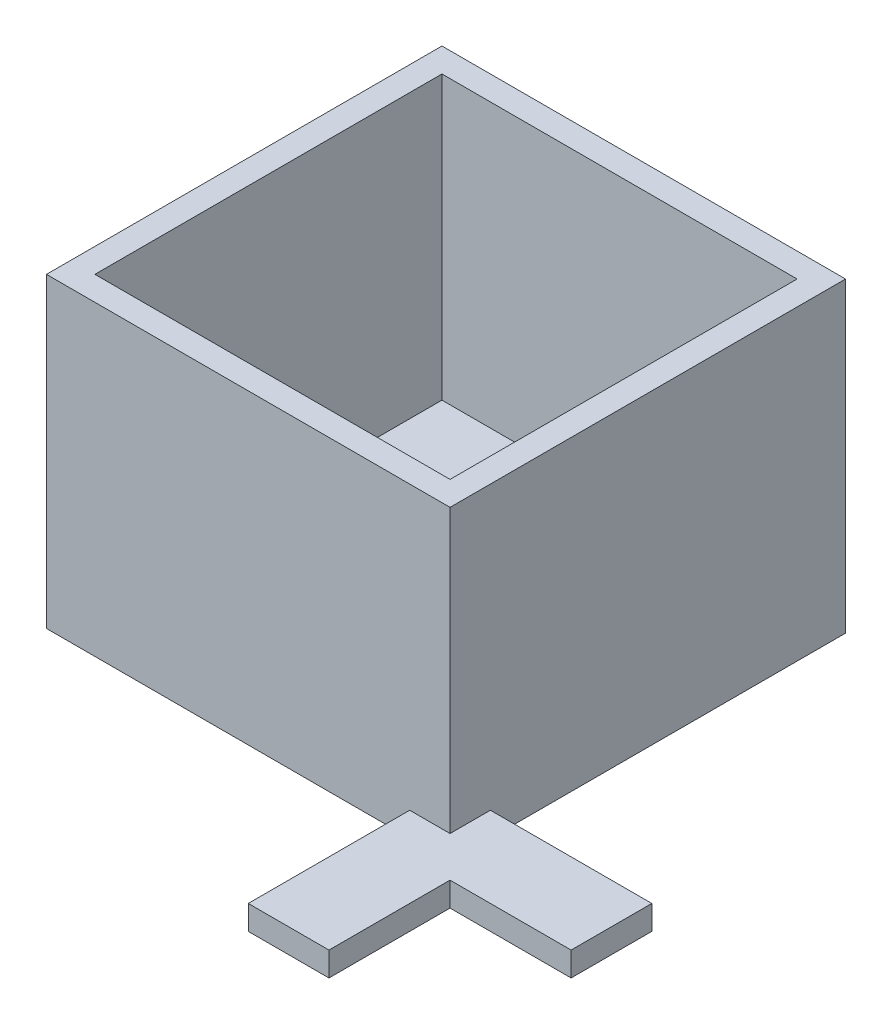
ISO-10303-21;
HEADER;
FILE_DESCRIPTION(('STEP AP214'),'2;1');
FILE_NAME('part.step','',(''),(''),'','','');
FILE_SCHEMA(('AUTOMOTIVE_DESIGN { 1 0 10303 214 1 1 1 1 }'));
ENDSEC;
DATA;
#1=APPLICATION_CONTEXT('core data for automotive mechanical design processes');
#2=APPLICATION_PROTOCOL_DEFINITION('international standard','automotive_design',2000,#1);
#3=PRODUCT_CONTEXT('',#1,'mechanical');
#4=PRODUCT('Part','Part','',(#3));
#5=PRODUCT_RELATED_PRODUCT_CATEGORY('part','',(#4));
#6=PRODUCT_DEFINITION_FORMATION('','',#4);
#7=PRODUCT_DEFINITION_CONTEXT('part definition',#1,'design');
#8=PRODUCT_DEFINITION('design','',#6,#7);
#9=PRODUCT_DEFINITION_SHAPE('','',#8);
#10=(LENGTH_UNIT() NAMED_UNIT(*) SI_UNIT(.MILLI.,.METRE.));
#11=(NAMED_UNIT(*) PLANE_ANGLE_UNIT() SI_UNIT($,.RADIAN.));
#12=(NAMED_UNIT(*) SI_UNIT($,.STERADIAN.) SOLID_ANGLE_UNIT());
#13=UNCERTAINTY_MEASURE_WITH_UNIT(LENGTH_MEASURE(1.E-05),#10,'distance_accuracy_value','');
#14=(GEOMETRIC_REPRESENTATION_CONTEXT(3) GLOBAL_UNCERTAINTY_ASSIGNED_CONTEXT((#13)) GLOBAL_UNIT_ASSIGNED_CONTEXT((#10,
#11,#12)) REPRESENTATION_CONTEXT('',''));
#15=CARTESIAN_POINT('',(0.,0.,0.));
#16=DIRECTION('',(0.,0.,1.));
#17=DIRECTION('',(1.,0.,0.));
#18=AXIS2_PLACEMENT_3D('',#15,#16,#17);
#19=CARTESIAN_POINT('',(0.,38.,0.));
#20=DIRECTION('',(1.,0.,0.));
#21=DIRECTION('',(0.,0.,-1.));
#22=AXIS2_PLACEMENT_3D('',#19,#20,#21);
#23=PLANE('',#22);
#24=DIRECTION('',(0.,0.,1.));
#25=VECTOR('',#24,1.);
#26=CARTESIAN_POINT('',(0.,0.,0.));
#27=LINE('',#26,#25);
#28=CARTESIAN_POINT('',(0.,0.,-49.));
#29=VERTEX_POINT('',#28);
#30=CARTESIAN_POINT('',(0.,0.,0.));
#31=VERTEX_POINT('',#30);
#32=EDGE_CURVE('E275',#29,#31,#27,.T.);
#33=ORIENTED_EDGE('',*,*,#32,.T.);
#34=DIRECTION('',(0.,-1.,0.));
#35=VECTOR('',#34,1.);
#36=CARTESIAN_POINT('',(0.,38.,0.));
#37=LINE('',#36,#35);
#38=CARTESIAN_POINT('',(0.,38.,0.));
#39=VERTEX_POINT('',#38);
#40=EDGE_CURVE('E12',#39,#31,#37,.T.);
#41=ORIENTED_EDGE('',*,*,#40,.F.);
#42=DIRECTION('',(0.,0.,1.));
#43=VECTOR('',#42,1.);
#44=CARTESIAN_POINT('',(0.,38.,0.));
#45=LINE('',#44,#43);
#46=CARTESIAN_POINT('',(0.,38.,-49.));
#47=VERTEX_POINT('',#46);
#48=EDGE_CURVE('E276',#47,#39,#45,.T.);
#49=ORIENTED_EDGE('',*,*,#48,.F.);
#50=DIRECTION('',(0.,-1.,0.));
#51=VECTOR('',#50,1.);
#52=CARTESIAN_POINT('',(0.,38.,-49.));
#53=LINE('',#52,#51);
#54=EDGE_CURVE('E290',#47,#29,#53,.T.);
#55=ORIENTED_EDGE('',*,*,#54,.T.);
#56=EDGE_LOOP('',(#33,#41,#49,#55));
#57=FACE_BOUND('',#56,.T.);
#58=ADVANCED_FACE('F41',(#57),#23,.F.);
#59=CARTESIAN_POINT('',(0.,38.,0.));
#60=DIRECTION('',(0.,0.,-1.));
#61=DIRECTION('',(-1.,0.,0.));
#62=AXIS2_PLACEMENT_3D('',#59,#60,#61);
#63=PLANE('',#62);
#64=DIRECTION('',(1.,0.,0.));
#65=VECTOR('',#64,1.);
#66=CARTESIAN_POINT('',(0.,0.,0.));
#67=LINE('',#66,#65);
#68=CARTESIAN_POINT('',(45.,0.,0.));
#69=VERTEX_POINT('',#68);
#70=EDGE_CURVE('E294',#31,#69,#67,.T.);
#71=ORIENTED_EDGE('',*,*,#70,.T.);
#72=DIRECTION('',(0.,-1.,0.));
#73=VECTOR('',#72,1.);
#74=CARTESIAN_POINT('',(45.,3.,0.));
#75=LINE('',#74,#73);
#76=CARTESIAN_POINT('',(45.,3.,0.));
#77=VERTEX_POINT('',#76);
#78=EDGE_CURVE('E56',#77,#69,#75,.T.);
#79=ORIENTED_EDGE('',*,*,#78,.F.);
#80=DIRECTION('',(1.,0.,0.));
#81=VECTOR('',#80,1.);
#82=CARTESIAN_POINT('',(50.,3.,0.));
#83=LINE('',#82,#81);
#84=CARTESIAN_POINT('',(50.,3.,0.));
#85=VERTEX_POINT('',#84);
#86=EDGE_CURVE('E193',#77,#85,#83,.T.);
#87=ORIENTED_EDGE('',*,*,#86,.T.);
#88=DIRECTION('',(0.,-1.,0.));
#89=VECTOR('',#88,1.);
#90=CARTESIAN_POINT('',(50.,38.,0.));
#91=LINE('',#90,#89);
#92=CARTESIAN_POINT('',(50.,38.,0.));
#93=VERTEX_POINT('',#92);
#94=EDGE_CURVE('E49',#93,#85,#91,.T.);
#95=ORIENTED_EDGE('',*,*,#94,.F.);
#96=DIRECTION('',(1.,0.,0.));
#97=VECTOR('',#96,1.);
#98=CARTESIAN_POINT('',(0.,38.,0.));
#99=LINE('',#98,#97);
#100=EDGE_CURVE('E280',#39,#93,#99,.T.);
#101=ORIENTED_EDGE('',*,*,#100,.F.);
#102=ORIENTED_EDGE('',*,*,#40,.T.);
#103=EDGE_LOOP('',(#71,#79,#87,#95,#101,#102));
#104=FACE_BOUND('',#103,.T.);
#105=ADVANCED_FACE('F316',(#104),#63,.F.);
#106=CARTESIAN_POINT('',(50.,38.,0.));
#107=DIRECTION('',(-1.,0.,0.));
#108=DIRECTION('',(0.,0.,1.));
#109=AXIS2_PLACEMENT_3D('',#106,#107,#108);
#110=PLANE('',#109);
#111=DIRECTION('',(0.,0.,-1.));
#112=VECTOR('',#111,1.);
#113=CARTESIAN_POINT('',(50.,3.,-5.));
#114=LINE('',#113,#112);
#115=CARTESIAN_POINT('',(50.,3.,-5.));
#116=VERTEX_POINT('',#115);
#117=EDGE_CURVE('E64',#85,#116,#114,.T.);
#118=ORIENTED_EDGE('',*,*,#117,.T.);
#119=DIRECTION('',(0.,-1.,0.));
#120=VECTOR('',#119,1.);
#121=CARTESIAN_POINT('',(50.,3.,-5.));
#122=LINE('',#121,#120);
#123=CARTESIAN_POINT('',(50.,0.,-5.));
#124=VERTEX_POINT('',#123);
#125=EDGE_CURVE('E161',#116,#124,#122,.T.);
#126=ORIENTED_EDGE('',*,*,#125,.T.);
#127=DIRECTION('',(0.,0.,-1.));
#128=VECTOR('',#127,1.);
#129=CARTESIAN_POINT('',(50.,0.,0.));
#130=LINE('',#129,#128);
#131=CARTESIAN_POINT('',(50.,0.,-49.));
#132=VERTEX_POINT('',#131);
#133=EDGE_CURVE('E297',#124,#132,#130,.T.);
#134=ORIENTED_EDGE('',*,*,#133,.T.);
#135=DIRECTION('',(0.,-1.,0.));
#136=VECTOR('',#135,1.);
#137=CARTESIAN_POINT('',(50.,38.,-49.));
#138=LINE('',#137,#136);
#139=CARTESIAN_POINT('',(50.,38.,-49.));
#140=VERTEX_POINT('',#139);
#141=EDGE_CURVE('E305',#140,#132,#138,.T.);
#142=ORIENTED_EDGE('',*,*,#141,.F.);
#143=DIRECTION('',(0.,0.,-1.));
#144=VECTOR('',#143,1.);
#145=CARTESIAN_POINT('',(50.,38.,0.));
#146=LINE('',#145,#144);
#147=EDGE_CURVE('E284',#93,#140,#146,.T.);
#148=ORIENTED_EDGE('',*,*,#147,.F.);
#149=ORIENTED_EDGE('',*,*,#94,.T.);
#150=EDGE_LOOP('',(#118,#126,#134,#142,#148,#149));
#151=FACE_BOUND('',#150,.T.);
#152=ADVANCED_FACE('F311',(#151),#110,.F.);
#153=CARTESIAN_POINT('',(0.,38.,-49.));
#154=DIRECTION('',(0.,0.,1.));
#155=DIRECTION('',(1.,0.,0.));
#156=AXIS2_PLACEMENT_3D('',#153,#154,#155);
#157=PLANE('',#156);
#158=DIRECTION('',(-1.,0.,0.));
#159=VECTOR('',#158,1.);
#160=CARTESIAN_POINT('',(0.,0.,-49.));
#161=LINE('',#160,#159);
#162=EDGE_CURVE('E281',#132,#29,#161,.T.);
#163=ORIENTED_EDGE('',*,*,#162,.T.);
#164=ORIENTED_EDGE('',*,*,#54,.F.);
#165=DIRECTION('',(-1.,0.,0.));
#166=VECTOR('',#165,1.);
#167=CARTESIAN_POINT('',(0.,38.,-49.));
#168=LINE('',#167,#166);
#169=EDGE_CURVE('E287',#140,#47,#168,.T.);
#170=ORIENTED_EDGE('',*,*,#169,.F.);
#171=ORIENTED_EDGE('',*,*,#141,.T.);
#172=EDGE_LOOP('',(#163,#164,#170,#171));
#173=FACE_BOUND('',#172,.T.);
#174=ADVANCED_FACE('F322',(#173),#157,.F.);
#175=CARTESIAN_POINT('',(0.,38.,0.));
#176=DIRECTION('',(0.,-1.,0.));
#177=DIRECTION('',(0.,0.,-1.));
#178=AXIS2_PLACEMENT_3D('',#175,#176,#177);
#179=PLANE('',#178);
#180=DIRECTION('',(1.,0.,0.));
#181=VECTOR('',#180,1.);
#182=CARTESIAN_POINT('',(3.,38.,-3.));
#183=LINE('',#182,#181);
#184=CARTESIAN_POINT('',(3.,38.,-3.));
#185=VERTEX_POINT('',#184);
#186=CARTESIAN_POINT('',(47.,38.,-3.));
#187=VERTEX_POINT('',#186);
#188=EDGE_CURVE('E236',#185,#187,#183,.T.);
#189=ORIENTED_EDGE('',*,*,#188,.F.);
#190=DIRECTION('',(0.,0.,1.));
#191=VECTOR('',#190,1.);
#192=CARTESIAN_POINT('',(3.,38.,-46.));
#193=LINE('',#192,#191);
#194=CARTESIAN_POINT('',(3.,38.,-46.));
#195=VERTEX_POINT('',#194);
#196=EDGE_CURVE('E240',#195,#185,#193,.T.);
#197=ORIENTED_EDGE('',*,*,#196,.F.);
#198=DIRECTION('',(-1.,0.,0.));
#199=VECTOR('',#198,1.);
#200=CARTESIAN_POINT('',(47.,38.,-46.));
#201=LINE('',#200,#199);
#202=CARTESIAN_POINT('',(47.,38.,-46.));
#203=VERTEX_POINT('',#202);
#204=EDGE_CURVE('E218',#203,#195,#201,.T.);
#205=ORIENTED_EDGE('',*,*,#204,.F.);
#206=DIRECTION('',(0.,0.,-1.));
#207=VECTOR('',#206,1.);
#208=CARTESIAN_POINT('',(47.,38.,-3.));
#209=LINE('',#208,#207);
#210=EDGE_CURVE('E232',#187,#203,#209,.T.);
#211=ORIENTED_EDGE('',*,*,#210,.F.);
#212=EDGE_LOOP('',(#189,#197,#205,#211));
#213=FACE_BOUND('',#212,.T.);
#214=ORIENTED_EDGE('',*,*,#48,.T.);
#215=ORIENTED_EDGE('',*,*,#100,.T.);
#216=ORIENTED_EDGE('',*,*,#147,.T.);
#217=ORIENTED_EDGE('',*,*,#169,.T.);
#218=EDGE_LOOP('',(#214,#215,#216,#217));
#219=FACE_BOUND('',#218,.T.);
#220=ADVANCED_FACE('F328',(#213,#219),#179,.F.);
#221=CARTESIAN_POINT('',(0.,0.,0.));
#222=DIRECTION('',(0.,-1.,0.));
#223=DIRECTION('',(0.,0.,-1.));
#224=AXIS2_PLACEMENT_3D('',#221,#222,#223);
#225=PLANE('',#224);
#226=ORIENTED_EDGE('',*,*,#133,.F.);
#227=DIRECTION('',(1.,0.,0.));
#228=VECTOR('',#227,1.);
#229=CARTESIAN_POINT('',(70.,0.,-5.));
#230=LINE('',#229,#228);
#231=CARTESIAN_POINT('',(70.,0.,-5.));
#232=VERTEX_POINT('',#231);
#233=EDGE_CURVE('E196',#124,#232,#230,.T.);
#234=ORIENTED_EDGE('',*,*,#233,.T.);
#235=DIRECTION('',(0.,0.,1.));
#236=VECTOR('',#235,1.);
#237=CARTESIAN_POINT('',(70.,0.,5.));
#238=LINE('',#237,#236);
#239=CARTESIAN_POINT('',(70.,0.,5.));
#240=VERTEX_POINT('',#239);
#241=EDGE_CURVE('E154',#232,#240,#238,.T.);
#242=ORIENTED_EDGE('',*,*,#241,.T.);
#243=DIRECTION('',(-1.,0.,0.));
#244=VECTOR('',#243,1.);
#245=CARTESIAN_POINT('',(55.,0.,5.));
#246=LINE('',#245,#244);
#247=CARTESIAN_POINT('',(55.,0.,5.));
#248=VERTEX_POINT('',#247);
#249=EDGE_CURVE('E201',#240,#248,#246,.T.);
#250=ORIENTED_EDGE('',*,*,#249,.T.);
#251=DIRECTION('',(0.,0.,1.));
#252=VECTOR('',#251,1.);
#253=CARTESIAN_POINT('',(55.,0.,20.));
#254=LINE('',#253,#252);
#255=CARTESIAN_POINT('',(55.,0.,20.));
#256=VERTEX_POINT('',#255);
#257=EDGE_CURVE('E205',#248,#256,#254,.T.);
#258=ORIENTED_EDGE('',*,*,#257,.T.);
#259=DIRECTION('',(-1.,0.,0.));
#260=VECTOR('',#259,1.);
#261=CARTESIAN_POINT('',(45.,0.,20.));
#262=LINE('',#261,#260);
#263=CARTESIAN_POINT('',(45.,0.,20.));
#264=VERTEX_POINT('',#263);
#265=EDGE_CURVE('E209',#256,#264,#262,.T.);
#266=ORIENTED_EDGE('',*,*,#265,.T.);
#267=DIRECTION('',(0.,0.,-1.));
#268=VECTOR('',#267,1.);
#269=CARTESIAN_POINT('',(45.,0.,0.));
#270=LINE('',#269,#268);
#271=EDGE_CURVE('E177',#264,#69,#270,.T.);
#272=ORIENTED_EDGE('',*,*,#271,.T.);
#273=ORIENTED_EDGE('',*,*,#70,.F.);
#274=ORIENTED_EDGE('',*,*,#32,.F.);
#275=ORIENTED_EDGE('',*,*,#162,.F.);
#276=EDGE_LOOP('',(#226,#234,#242,#250,#258,#266,#272,#273,#274,#275));
#277=FACE_BOUND('',#276,.T.);
#278=ADVANCED_FACE('F330',(#277),#225,.T.);
#279=CARTESIAN_POINT('',(0.,3.,0.));
#280=DIRECTION('',(0.,-1.,0.));
#281=DIRECTION('',(0.,0.,-1.));
#282=AXIS2_PLACEMENT_3D('',#279,#280,#281);
#283=PLANE('',#282);
#284=DIRECTION('',(-1.,0.,0.));
#285=VECTOR('',#284,1.);
#286=CARTESIAN_POINT('',(47.,3.,-46.));
#287=LINE('',#286,#285);
#288=CARTESIAN_POINT('',(47.,3.,-46.));
#289=VERTEX_POINT('',#288);
#290=CARTESIAN_POINT('',(3.,3.,-46.));
#291=VERTEX_POINT('',#290);
#292=EDGE_CURVE('E251',#289,#291,#287,.T.);
#293=ORIENTED_EDGE('',*,*,#292,.T.);
#294=DIRECTION('',(0.,0.,1.));
#295=VECTOR('',#294,1.);
#296=CARTESIAN_POINT('',(3.,3.,-46.));
#297=LINE('',#296,#295);
#298=CARTESIAN_POINT('',(3.,2.99999999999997,-3.));
#299=VERTEX_POINT('',#298);
#300=EDGE_CURVE('E235',#291,#299,#297,.T.);
#301=ORIENTED_EDGE('',*,*,#300,.T.);
#302=DIRECTION('',(1.,0.,0.));
#303=VECTOR('',#302,1.);
#304=CARTESIAN_POINT('',(3.,3.,-3.));
#305=LINE('',#304,#303);
#306=CARTESIAN_POINT('',(47.,3.,-3.));
#307=VERTEX_POINT('',#306);
#308=EDGE_CURVE('E262',#299,#307,#305,.T.);
#309=ORIENTED_EDGE('',*,*,#308,.T.);
#310=DIRECTION('',(0.,0.,-1.));
#311=VECTOR('',#310,1.);
#312=CARTESIAN_POINT('',(47.,3.,-3.));
#313=LINE('',#312,#311);
#314=EDGE_CURVE('E257',#307,#289,#313,.T.);
#315=ORIENTED_EDGE('',*,*,#314,.T.);
#316=EDGE_LOOP('',(#293,#301,#309,#315));
#317=FACE_BOUND('',#316,.T.);
#318=ADVANCED_FACE('F333',(#317),#283,.F.);
#319=CARTESIAN_POINT('',(3.,-61.5223536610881,-46.));
#320=DIRECTION('',(-1.,0.,0.));
#321=DIRECTION('',(0.,0.,1.));
#322=AXIS2_PLACEMENT_3D('',#319,#320,#321);
#323=PLANE('',#322);
#324=DIRECTION('',(0.,1.,0.));
#325=VECTOR('',#324,1.);
#326=CARTESIAN_POINT('',(3.,-61.5223536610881,-46.));
#327=LINE('',#326,#325);
#328=EDGE_CURVE('E255',#291,#195,#327,.T.);
#329=ORIENTED_EDGE('',*,*,#328,.T.);
#330=ORIENTED_EDGE('',*,*,#196,.T.);
#331=DIRECTION('',(0.,1.,0.));
#332=VECTOR('',#331,1.);
#333=CARTESIAN_POINT('',(3.,-61.5223536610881,-3.));
#334=LINE('',#333,#332);
#335=EDGE_CURVE('E250',#299,#185,#334,.T.);
#336=ORIENTED_EDGE('',*,*,#335,.F.);
#337=ORIENTED_EDGE('',*,*,#300,.F.);
#338=EDGE_LOOP('',(#329,#330,#336,#337));
#339=FACE_BOUND('',#338,.T.);
#340=ADVANCED_FACE('F340',(#339),#323,.F.);
#341=CARTESIAN_POINT('',(3.,-61.5223536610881,-3.));
#342=DIRECTION('',(0.,0.,1.));
#343=DIRECTION('',(1.,0.,0.));
#344=AXIS2_PLACEMENT_3D('',#341,#342,#343);
#345=PLANE('',#344);
#346=ORIENTED_EDGE('',*,*,#335,.T.);
#347=ORIENTED_EDGE('',*,*,#188,.T.);
#348=DIRECTION('',(0.,1.,0.));
#349=VECTOR('',#348,1.);
#350=CARTESIAN_POINT('',(47.,-61.5223536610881,-3.));
#351=LINE('',#350,#349);
#352=EDGE_CURVE('E261',#307,#187,#351,.T.);
#353=ORIENTED_EDGE('',*,*,#352,.F.);
#354=ORIENTED_EDGE('',*,*,#308,.F.);
#355=EDGE_LOOP('',(#346,#347,#353,#354));
#356=FACE_BOUND('',#355,.T.);
#357=ADVANCED_FACE('F344',(#356),#345,.F.);
#358=CARTESIAN_POINT('',(47.,-61.5223536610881,-3.));
#359=DIRECTION('',(1.,0.,0.));
#360=DIRECTION('',(0.,0.,-1.));
#361=AXIS2_PLACEMENT_3D('',#358,#359,#360);
#362=PLANE('',#361);
#363=ORIENTED_EDGE('',*,*,#352,.T.);
#364=ORIENTED_EDGE('',*,*,#210,.T.);
#365=DIRECTION('',(0.,1.,0.));
#366=VECTOR('',#365,1.);
#367=CARTESIAN_POINT('',(47.,-61.5223536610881,-46.));
#368=LINE('',#367,#366);
#369=EDGE_CURVE('E256',#289,#203,#368,.T.);
#370=ORIENTED_EDGE('',*,*,#369,.F.);
#371=ORIENTED_EDGE('',*,*,#314,.F.);
#372=EDGE_LOOP('',(#363,#364,#370,#371));
#373=FACE_BOUND('',#372,.T.);
#374=ADVANCED_FACE('F348',(#373),#362,.F.);
#375=CARTESIAN_POINT('',(47.,-61.5223536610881,-46.));
#376=DIRECTION('',(0.,0.,-1.));
#377=DIRECTION('',(-1.,0.,0.));
#378=AXIS2_PLACEMENT_3D('',#375,#376,#377);
#379=PLANE('',#378);
#380=ORIENTED_EDGE('',*,*,#369,.T.);
#381=ORIENTED_EDGE('',*,*,#204,.T.);
#382=ORIENTED_EDGE('',*,*,#328,.F.);
#383=ORIENTED_EDGE('',*,*,#292,.F.);
#384=EDGE_LOOP('',(#380,#381,#382,#383));
#385=FACE_BOUND('',#384,.T.);
#386=ADVANCED_FACE('F352',(#385),#379,.F.);
#387=CARTESIAN_POINT('',(45.,3.,0.));
#388=DIRECTION('',(-1.,0.,0.));
#389=DIRECTION('',(0.,0.,1.));
#390=AXIS2_PLACEMENT_3D('',#387,#388,#389);
#391=PLANE('',#390);
#392=ORIENTED_EDGE('',*,*,#271,.F.);
#393=DIRECTION('',(0.,-1.,0.));
#394=VECTOR('',#393,1.);
#395=CARTESIAN_POINT('',(45.,3.,20.));
#396=LINE('',#395,#394);
#397=CARTESIAN_POINT('',(45.,3.,20.));
#398=VERTEX_POINT('',#397);
#399=EDGE_CURVE('E219',#398,#264,#396,.T.);
#400=ORIENTED_EDGE('',*,*,#399,.F.);
#401=DIRECTION('',(0.,0.,-1.));
#402=VECTOR('',#401,1.);
#403=CARTESIAN_POINT('',(45.,3.,0.));
#404=LINE('',#403,#402);
#405=EDGE_CURVE('E190',#398,#77,#404,.T.);
#406=ORIENTED_EDGE('',*,*,#405,.T.);
#407=ORIENTED_EDGE('',*,*,#78,.T.);
#408=EDGE_LOOP('',(#392,#400,#406,#407));
#409=FACE_BOUND('',#408,.T.);
#410=ADVANCED_FACE('F356',(#409),#391,.T.);
#411=CARTESIAN_POINT('',(45.,3.,20.));
#412=DIRECTION('',(0.,0.,1.));
#413=DIRECTION('',(1.,0.,0.));
#414=AXIS2_PLACEMENT_3D('',#411,#412,#413);
#415=PLANE('',#414);
#416=ORIENTED_EDGE('',*,*,#265,.F.);
#417=DIRECTION('',(0.,-1.,0.));
#418=VECTOR('',#417,1.);
#419=CARTESIAN_POINT('',(55.,3.,20.));
#420=LINE('',#419,#418);
#421=CARTESIAN_POINT('',(55.,3.,20.));
#422=VERTEX_POINT('',#421);
#423=EDGE_CURVE('E222',#422,#256,#420,.T.);
#424=ORIENTED_EDGE('',*,*,#423,.F.);
#425=DIRECTION('',(-1.,0.,0.));
#426=VECTOR('',#425,1.);
#427=CARTESIAN_POINT('',(45.,3.,20.));
#428=LINE('',#427,#426);
#429=EDGE_CURVE('E186',#422,#398,#428,.T.);
#430=ORIENTED_EDGE('',*,*,#429,.T.);
#431=ORIENTED_EDGE('',*,*,#399,.T.);
#432=EDGE_LOOP('',(#416,#424,#430,#431));
#433=FACE_BOUND('',#432,.T.);
#434=ADVANCED_FACE('F369',(#433),#415,.T.);
#435=CARTESIAN_POINT('',(55.,3.,20.));
#436=DIRECTION('',(1.,0.,0.));
#437=DIRECTION('',(0.,0.,-1.));
#438=AXIS2_PLACEMENT_3D('',#435,#436,#437);
#439=PLANE('',#438);
#440=ORIENTED_EDGE('',*,*,#257,.F.);
#441=DIRECTION('',(0.,-1.,0.));
#442=VECTOR('',#441,1.);
#443=CARTESIAN_POINT('',(55.,3.,5.));
#444=LINE('',#443,#442);
#445=CARTESIAN_POINT('',(55.,3.,5.));
#446=VERTEX_POINT('',#445);
#447=EDGE_CURVE('E225',#446,#248,#444,.T.);
#448=ORIENTED_EDGE('',*,*,#447,.F.);
#449=DIRECTION('',(0.,0.,1.));
#450=VECTOR('',#449,1.);
#451=CARTESIAN_POINT('',(55.,3.,20.));
#452=LINE('',#451,#450);
#453=EDGE_CURVE('E182',#446,#422,#452,.T.);
#454=ORIENTED_EDGE('',*,*,#453,.T.);
#455=ORIENTED_EDGE('',*,*,#423,.T.);
#456=EDGE_LOOP('',(#440,#448,#454,#455));
#457=FACE_BOUND('',#456,.T.);
#458=ADVANCED_FACE('F365',(#457),#439,.T.);
#459=CARTESIAN_POINT('',(55.,3.,5.));
#460=DIRECTION('',(0.,0.,1.));
#461=DIRECTION('',(1.,0.,0.));
#462=AXIS2_PLACEMENT_3D('',#459,#460,#461);
#463=PLANE('',#462);
#464=ORIENTED_EDGE('',*,*,#249,.F.);
#465=DIRECTION('',(0.,-1.,0.));
#466=VECTOR('',#465,1.);
#467=CARTESIAN_POINT('',(70.,3.,5.));
#468=LINE('',#467,#466);
#469=CARTESIAN_POINT('',(70.,3.,5.));
#470=VERTEX_POINT('',#469);
#471=EDGE_CURVE('E160',#470,#240,#468,.T.);
#472=ORIENTED_EDGE('',*,*,#471,.F.);
#473=DIRECTION('',(-1.,0.,0.));
#474=VECTOR('',#473,1.);
#475=CARTESIAN_POINT('',(55.,3.,5.));
#476=LINE('',#475,#474);
#477=EDGE_CURVE('E170',#470,#446,#476,.T.);
#478=ORIENTED_EDGE('',*,*,#477,.T.);
#479=ORIENTED_EDGE('',*,*,#447,.T.);
#480=EDGE_LOOP('',(#464,#472,#478,#479));
#481=FACE_BOUND('',#480,.T.);
#482=ADVANCED_FACE('F362',(#481),#463,.T.);
#483=CARTESIAN_POINT('',(70.,3.,5.));
#484=DIRECTION('',(1.,0.,0.));
#485=DIRECTION('',(0.,0.,-1.));
#486=AXIS2_PLACEMENT_3D('',#483,#484,#485);
#487=PLANE('',#486);
#488=ORIENTED_EDGE('',*,*,#241,.F.);
#489=DIRECTION('',(0.,-1.,0.));
#490=VECTOR('',#489,1.);
#491=CARTESIAN_POINT('',(70.,3.,-5.));
#492=LINE('',#491,#490);
#493=CARTESIAN_POINT('',(70.,3.,-5.));
#494=VERTEX_POINT('',#493);
#495=EDGE_CURVE('E149',#494,#232,#492,.T.);
#496=ORIENTED_EDGE('',*,*,#495,.F.);
#497=DIRECTION('',(0.,0.,1.));
#498=VECTOR('',#497,1.);
#499=CARTESIAN_POINT('',(70.,3.,5.));
#500=LINE('',#499,#498);
#501=EDGE_CURVE('E152',#494,#470,#500,.T.);
#502=ORIENTED_EDGE('',*,*,#501,.T.);
#503=ORIENTED_EDGE('',*,*,#471,.T.);
#504=EDGE_LOOP('',(#488,#496,#502,#503));
#505=FACE_BOUND('',#504,.T.);
#506=ADVANCED_FACE('F151',(#505),#487,.T.);
#507=CARTESIAN_POINT('',(70.,3.,-5.));
#508=DIRECTION('',(0.,0.,-1.));
#509=DIRECTION('',(-1.,0.,0.));
#510=AXIS2_PLACEMENT_3D('',#507,#508,#509);
#511=PLANE('',#510);
#512=ORIENTED_EDGE('',*,*,#233,.F.);
#513=ORIENTED_EDGE('',*,*,#125,.F.);
#514=DIRECTION('',(1.,0.,0.));
#515=VECTOR('',#514,1.);
#516=CARTESIAN_POINT('',(70.,3.,-5.));
#517=LINE('',#516,#515);
#518=EDGE_CURVE('E167',#116,#494,#517,.T.);
#519=ORIENTED_EDGE('',*,*,#518,.T.);
#520=ORIENTED_EDGE('',*,*,#495,.T.);
#521=EDGE_LOOP('',(#512,#513,#519,#520));
#522=FACE_BOUND('',#521,.T.);
#523=ADVANCED_FACE('F173',(#522),#511,.T.);
#524=CARTESIAN_POINT('',(0.,3.,0.));
#525=DIRECTION('',(0.,-1.,0.));
#526=DIRECTION('',(0.,0.,-1.));
#527=AXIS2_PLACEMENT_3D('',#524,#525,#526);
#528=PLANE('',#527);
#529=ORIENTED_EDGE('',*,*,#117,.F.);
#530=ORIENTED_EDGE('',*,*,#86,.F.);
#531=ORIENTED_EDGE('',*,*,#405,.F.);
#532=ORIENTED_EDGE('',*,*,#429,.F.);
#533=ORIENTED_EDGE('',*,*,#453,.F.);
#534=ORIENTED_EDGE('',*,*,#477,.F.);
#535=ORIENTED_EDGE('',*,*,#501,.F.);
#536=ORIENTED_EDGE('',*,*,#518,.F.);
#537=EDGE_LOOP('',(#529,#530,#531,#532,#533,#534,#535,#536));
#538=FACE_BOUND('',#537,.T.);
#539=ADVANCED_FACE('F166',(#538),#528,.F.);
#540=CLOSED_SHELL('',(#58,#105,#152,#174,#220,#278,#318,#340,#357,#374,#386,#410,#434,#458,#482,
#506,#523,#539));
#541=MANIFOLD_SOLID_BREP('B2',#540);
#542=ADVANCED_BREP_SHAPE_REPRESENTATION('',(#18,#541),#14);
#543=SHAPE_DEFINITION_REPRESENTATION(#9,#542);
ENDSEC;
END-ISO-10303-21;
